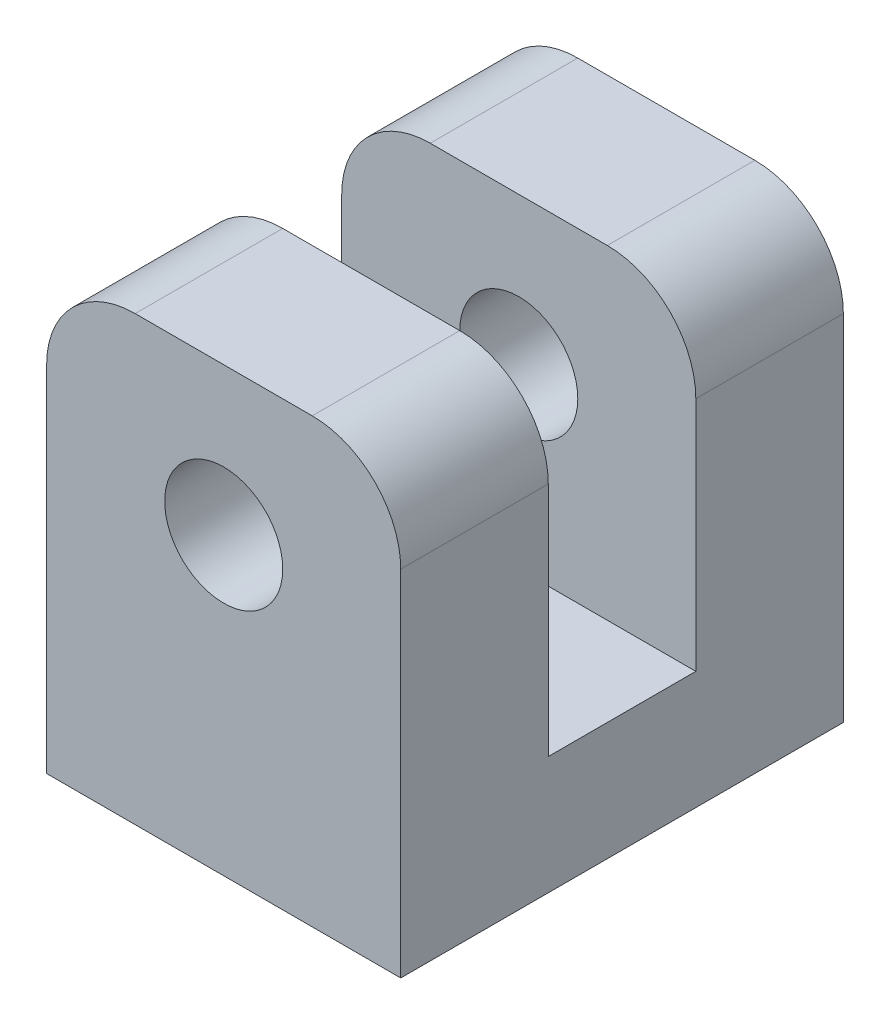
from build123d import *

# Parameters (mm, degrees)
SKETCH_1_W          = 120
SKETCH_1_H          = 150
EXTRUDE_1_DEPTH     = 150
SKETCH_2_W          = 120
SKETCH_2_H          = 50
CUT_EXTRUDE_2_DEPTH = 110
SKETCH_3_R          = 20
CUT_EXTRUDE_3_DEPTH = 244.721152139
SKETCH_4_R          = 30
CUT_EXTRUDE_4_DEPTH = 35
FILLET_1_R          = 30


with BuildPart() as part:
    # Sketch 1 → Extrude 1 (new body)
    with BuildSketch(Plane.XY):
        with Locations((60, 75)):
            Rectangle(SKETCH_1_W, SKETCH_1_H)
    extrude(amount=EXTRUDE_1_DEPTH)

    # Sketch 2 → Cut-Extrude 2 (cut)
    with BuildSketch(Plane(origin=(0, 150, 0), x_dir=(1, 0, 0), z_dir=(0, 1, 0))):
        with Locations((60, -75)):
            Rectangle(SKETCH_2_W, SKETCH_2_H)
    extrude(amount=-CUT_EXTRUDE_2_DEPTH, mode=Mode.SUBTRACT)

    # Sketch 3 → Cut-Extrude 3 (cut, through all)
    with BuildSketch(Plane.XY.offset(150)):
        with Locations((60, 100)):
            Circle(SKETCH_3_R)
    extrude(amount=-CUT_EXTRUDE_3_DEPTH, mode=Mode.SUBTRACT)

    # Sketch 4 → Cut-Extrude 4 (cut)
    with BuildSketch(Plane.XZ):
        with Locations(Location((60, 75, 0), (0, 0, 270))):
            Circle(SKETCH_4_R)
    extrude(amount=-CUT_EXTRUDE_4_DEPTH, mode=Mode.SUBTRACT)

    # Fillet 1
    fillet_1_edges = [part.edges().sort_by_distance(p)[0] for p in [
        (0, 150, 25),
        (120, 150, 25),
        (0, 150, 125),
        (120, 150, 125),
    ]]
    fillet(fillet_1_edges, radius=FILLET_1_R)


solid = part.part
